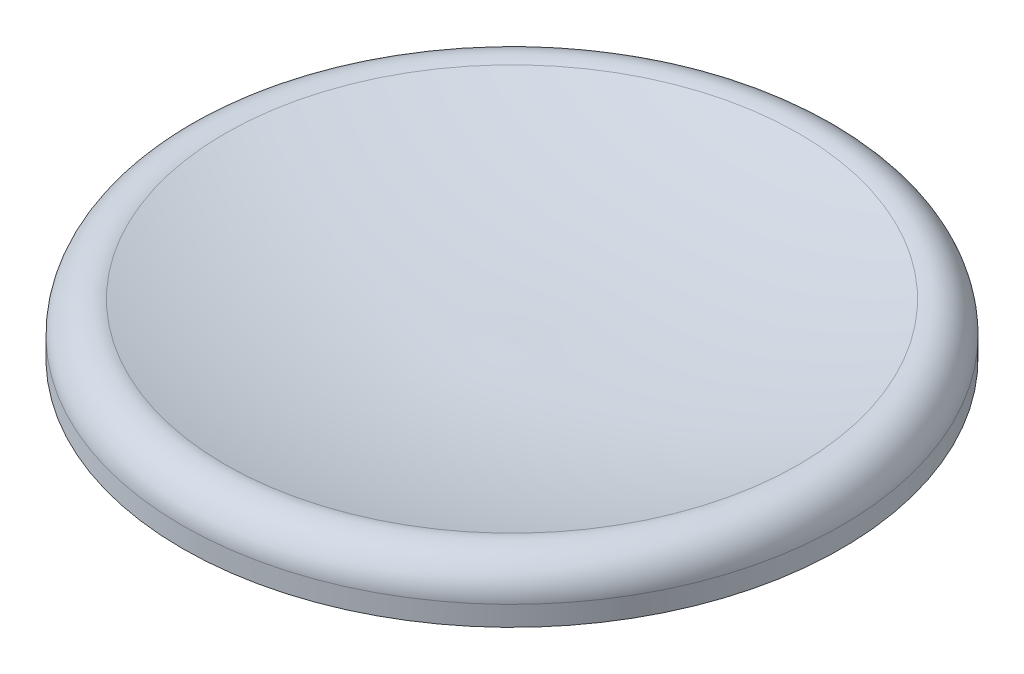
ISO-10303-21;
HEADER;
FILE_DESCRIPTION(('STEP AP214'),'2;1');
FILE_NAME('part.step','',(''),(''),'','','');
FILE_SCHEMA(('AUTOMOTIVE_DESIGN { 1 0 10303 214 1 1 1 1 }'));
ENDSEC;
DATA;
#1=APPLICATION_CONTEXT('core data for automotive mechanical design processes');
#2=APPLICATION_PROTOCOL_DEFINITION('international standard','automotive_design',2000,#1);
#3=PRODUCT_CONTEXT('',#1,'mechanical');
#4=PRODUCT('Part','Part','',(#3));
#5=PRODUCT_RELATED_PRODUCT_CATEGORY('part','',(#4));
#6=PRODUCT_DEFINITION_FORMATION('','',#4);
#7=PRODUCT_DEFINITION_CONTEXT('part definition',#1,'design');
#8=PRODUCT_DEFINITION('design','',#6,#7);
#9=PRODUCT_DEFINITION_SHAPE('','',#8);
#10=(LENGTH_UNIT() NAMED_UNIT(*) SI_UNIT(.MILLI.,.METRE.));
#11=(NAMED_UNIT(*) PLANE_ANGLE_UNIT() SI_UNIT($,.RADIAN.));
#12=(NAMED_UNIT(*) SI_UNIT($,.STERADIAN.) SOLID_ANGLE_UNIT());
#13=UNCERTAINTY_MEASURE_WITH_UNIT(LENGTH_MEASURE(1.E-05),#10,'distance_accuracy_value','');
#14=(GEOMETRIC_REPRESENTATION_CONTEXT(3) GLOBAL_UNCERTAINTY_ASSIGNED_CONTEXT((#13)) GLOBAL_UNIT_ASSIGNED_CONTEXT((#10,
#11,#12)) REPRESENTATION_CONTEXT('',''));
#15=CARTESIAN_POINT('',(0.,0.,0.));
#16=DIRECTION('',(0.,0.,1.));
#17=DIRECTION('',(1.,0.,0.));
#18=AXIS2_PLACEMENT_3D('',#15,#16,#17);
#19=CARTESIAN_POINT('',(0.,29.3818657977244,-0.970901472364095));
#20=DIRECTION('',(-1.,0.,0.));
#21=DIRECTION('',(0.,0.,-1.));
#22=AXIS2_PLACEMENT_3D('',#19,#20,#21);
#23=CIRCLE('',#22,26.);
#24=TRIMMED_CURVE('',#23,(PARAMETER_VALUE(-1.60814737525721)),
(PARAMETER_VALUE(1.60814737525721)),.T.,.PARAMETER.);
#25=CARTESIAN_POINT('',(0.,29.3818657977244,0.));
#26=DIRECTION('',(0.,-1.,0.));
#27=AXIS1_PLACEMENT('',#25,#26);
#28=SURFACE_OF_REVOLUTION('',#24,#27);
#29=CARTESIAN_POINT('',(0.,4.55807809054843,0.));
#30=DIRECTION('',(0.,1.,0.));
#31=DIRECTION('',(0.,0.,1.));
#32=AXIS2_PLACEMENT_3D('',#29,#30,#31);
#33=CIRCLE('',#32,8.70262598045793);
#34=CARTESIAN_POINT('',(0.,4.55807809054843,8.70262598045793));
#35=VERTEX_POINT('',#34);
#36=EDGE_CURVE('E11',#35,#35,#33,.T.);
#37=ORIENTED_EDGE('',*,*,#36,.T.);
#38=EDGE_LOOP('',(#37));
#39=FACE_BOUND('',#38,.T.);
#40=CARTESIAN_POINT('',(0.,3.4,0.));
#41=VERTEX_POINT('',#40);
#42=VERTEX_LOOP('',#41);
#43=FACE_BOUND('',#42,.T.);
#44=ADVANCED_FACE('F33',(#39,#43),#28,.F.);
#45=CARTESIAN_POINT('',(0.,0.,0.));
#46=DIRECTION('',(0.,-1.,0.));
#47=DIRECTION('',(0.,0.,-1.));
#48=AXIS2_PLACEMENT_3D('',#45,#46,#47);
#49=CYLINDRICAL_SURFACE('',#48,10.);
#50=CARTESIAN_POINT('',(0.,3.60331702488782,0.));
#51=DIRECTION('',(0.,1.,0.));
#52=DIRECTION('',(0.,0.,1.));
#53=AXIS2_PLACEMENT_3D('',#50,#51,#52);
#54=CIRCLE('',#53,10.);
#55=CARTESIAN_POINT('',(0.,3.60331702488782,10.));
#56=VERTEX_POINT('',#55);
#57=EDGE_CURVE('E40',#56,#56,#54,.F.);
#58=ORIENTED_EDGE('',*,*,#57,.T.);
#59=EDGE_LOOP('',(#58));
#60=FACE_BOUND('',#59,.T.);
#61=CARTESIAN_POINT('',(0.,3.,0.));
#62=DIRECTION('',(0.,-1.,0.));
#63=DIRECTION('',(0.,0.,-1.));
#64=AXIS2_PLACEMENT_3D('',#61,#62,#63);
#65=CIRCLE('',#64,10.);
#66=CARTESIAN_POINT('',(0.,3.,-10.));
#67=VERTEX_POINT('',#66);
#68=EDGE_CURVE('E74',#67,#67,#65,.T.);
#69=ORIENTED_EDGE('',*,*,#68,.F.);
#70=EDGE_LOOP('',(#69));
#71=FACE_BOUND('',#70,.T.);
#72=ADVANCED_FACE('F44',(#60,#71),#49,.T.);
#73=CARTESIAN_POINT('',(4.,3.,0.));
#74=DIRECTION('',(0.,-1.,0.));
#75=DIRECTION('',(0.,0.,-1.));
#76=AXIS2_PLACEMENT_3D('',#73,#74,#75);
#77=PLANE('',#76);
#78=ORIENTED_EDGE('',*,*,#68,.T.);
#79=EDGE_LOOP('',(#78));
#80=FACE_BOUND('',#79,.T.);
#81=CARTESIAN_POINT('',(0.,3.,0.));
#82=DIRECTION('',(0.,-1.,0.));
#83=DIRECTION('',(0.,0.,-1.));
#84=AXIS2_PLACEMENT_3D('',#81,#82,#83);
#85=CIRCLE('',#84,4.);
#86=CARTESIAN_POINT('',(0.,3.,-4.));
#87=VERTEX_POINT('',#86);
#88=EDGE_CURVE('E71',#87,#87,#85,.T.);
#89=ORIENTED_EDGE('',*,*,#88,.F.);
#90=EDGE_LOOP('',(#89));
#91=FACE_BOUND('',#90,.T.);
#92=ADVANCED_FACE('F49',(#80,#91),#77,.T.);
#93=CARTESIAN_POINT('',(0.,0.,0.));
#94=DIRECTION('',(0.,-1.,0.));
#95=DIRECTION('',(0.,0.,-1.));
#96=AXIS2_PLACEMENT_3D('',#93,#94,#95);
#97=CYLINDRICAL_SURFACE('',#96,4.);
#98=ORIENTED_EDGE('',*,*,#88,.T.);
#99=EDGE_LOOP('',(#98));
#100=FACE_BOUND('',#99,.T.);
#101=CARTESIAN_POINT('',(0.,0.,0.));
#102=DIRECTION('',(0.,-1.,0.));
#103=DIRECTION('',(0.,0.,-1.));
#104=AXIS2_PLACEMENT_3D('',#101,#102,#103);
#105=CIRCLE('',#104,4.);
#106=CARTESIAN_POINT('',(0.,0.,-4.));
#107=VERTEX_POINT('',#106);
#108=EDGE_CURVE('E69',#107,#107,#105,.T.);
#109=ORIENTED_EDGE('',*,*,#108,.F.);
#110=EDGE_LOOP('',(#109));
#111=FACE_BOUND('',#110,.T.);
#112=ADVANCED_FACE('F55',(#100,#111),#97,.T.);
#113=CARTESIAN_POINT('',(0.,0.,0.));
#114=DIRECTION('',(0.,-1.,0.));
#115=DIRECTION('',(0.,0.,-1.));
#116=AXIS2_PLACEMENT_3D('',#113,#114,#115);
#117=PLANE('',#116);
#118=ORIENTED_EDGE('',*,*,#108,.T.);
#119=EDGE_LOOP('',(#118));
#120=FACE_BOUND('',#119,.T.);
#121=ADVANCED_FACE('F59',(#120),#117,.T.);
#122=CARTESIAN_POINT('',(0.,3.60331702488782,0.));
#123=DIRECTION('',(0.,1.,0.));
#124=DIRECTION('',(0.,0.,1.));
#125=AXIS2_PLACEMENT_3D('',#122,#123,#124);
#126=TOROIDAL_SURFACE('',#125,9.,1.);
#127=ORIENTED_EDGE('',*,*,#36,.F.);
#128=EDGE_LOOP('',(#127));
#129=FACE_BOUND('',#128,.T.);
#130=ORIENTED_EDGE('',*,*,#57,.F.);
#131=EDGE_LOOP('',(#130));
#132=FACE_BOUND('',#131,.T.);
#133=ADVANCED_FACE('F35',(#129,#132),#126,.T.);
#134=CLOSED_SHELL('',(#44,#72,#92,#112,#121,#133));
#135=MANIFOLD_SOLID_BREP('B2',#134);
#136=ADVANCED_BREP_SHAPE_REPRESENTATION('',(#18,#135),#14);
#137=SHAPE_DEFINITION_REPRESENTATION(#9,#136);
ENDSEC;
END-ISO-10303-21;
